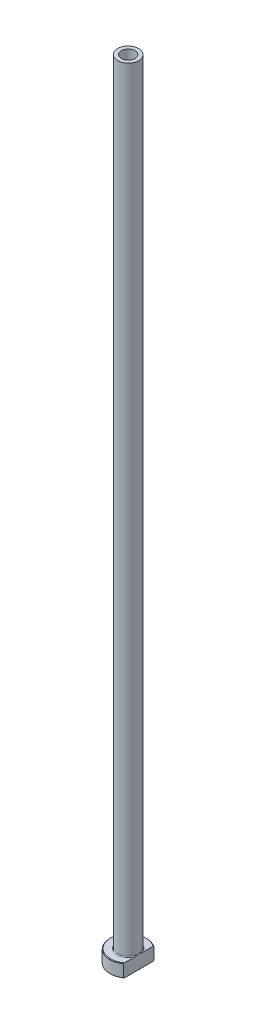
from build123d import *

# Parameters (mm, degrees)
FILLET1_R          = 0.3
CHAMFER1_SIZE      = 0.2
CUT_EXTRUDE1_DEPTH = 301.163288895
CHAMFER2_SIZE      = 0.5


with BuildPart() as part:
    # Sketch1 → Revolve1 (revolve)
    with BuildSketch(Plane.XY, mode=Mode.PRIVATE) as revolve1_sk:
        Polygon((-2.6, 300), (-4, 300), (-4, 5), (-7, 5), (-7, 0), (-2.85, 0), (-2.85, 243), (-2.6, 255), align=None)
    revolve(revolve1_sk.sketch.rotate(Axis((0, 92.187680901, 0), (0, -1, 0)), 270), axis=Axis((0, 92.187680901, 0), (0, -1, 0)))

    # Fillet1
    fillet1_edges = [part.edges().sort_by_distance(p)[0] for p in [
        (0, 5, -4),
    ]]
    fillet(fillet1_edges, radius=FILLET1_R)

    # Chamfer1
    chamfer1_edges = [part.edges().sort_by_distance(p)[0] for p in [
        (0, 0, -7),
        (0, 5, -7),
    ]]
    chamfer(chamfer1_edges, length=CHAMFER1_SIZE)

    # Sketch2 → Cut-Extrude1 (cut, through all)
    with BuildSketch(Plane.XZ):
        with BuildLine():
            Line((4, 5.744562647), (4, -5.744562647))
            ThreePointArc((4, -5.744562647), (7, 0), (4, 5.744562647))
        make_face()
    extrude(amount=-CUT_EXTRUDE1_DEPTH, mode=Mode.SUBTRACT)

    # Chamfer2
    chamfer2_edges = [part.edges().sort_by_distance(p)[0] for p in [
        (0, 0, -2.85),
    ]]
    chamfer(chamfer2_edges, length=CHAMFER2_SIZE)


solid = part.part
